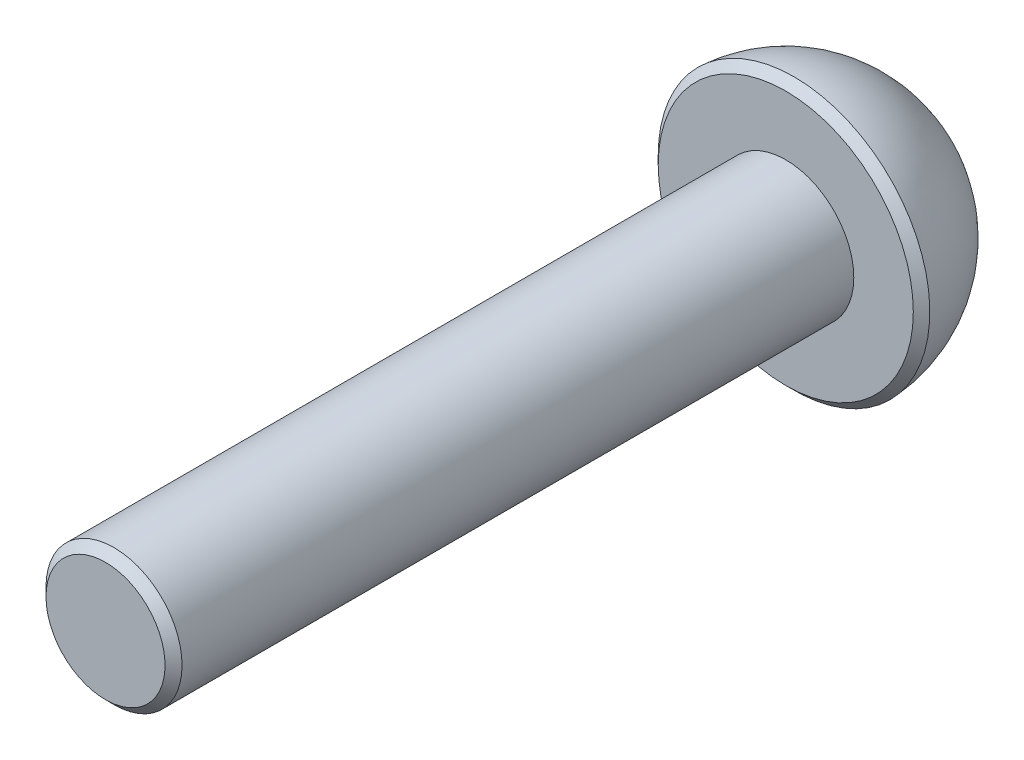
ISO-10303-21;
HEADER;
FILE_DESCRIPTION(('STEP AP214'),'2;1');
FILE_NAME('part.step','',(''),(''),'','','');
FILE_SCHEMA(('AUTOMOTIVE_DESIGN { 1 0 10303 214 1 1 1 1 }'));
ENDSEC;
DATA;
#1=APPLICATION_CONTEXT('core data for automotive mechanical design processes');
#2=APPLICATION_PROTOCOL_DEFINITION('international standard','automotive_design',2000,#1);
#3=PRODUCT_CONTEXT('',#1,'mechanical');
#4=PRODUCT('Part','Part','',(#3));
#5=PRODUCT_RELATED_PRODUCT_CATEGORY('part','',(#4));
#6=PRODUCT_DEFINITION_FORMATION('','',#4);
#7=PRODUCT_DEFINITION_CONTEXT('part definition',#1,'design');
#8=PRODUCT_DEFINITION('design','',#6,#7);
#9=PRODUCT_DEFINITION_SHAPE('','',#8);
#10=(LENGTH_UNIT() NAMED_UNIT(*) SI_UNIT(.MILLI.,.METRE.));
#11=(NAMED_UNIT(*) PLANE_ANGLE_UNIT() SI_UNIT($,.RADIAN.));
#12=(NAMED_UNIT(*) SI_UNIT($,.STERADIAN.) SOLID_ANGLE_UNIT());
#13=UNCERTAINTY_MEASURE_WITH_UNIT(LENGTH_MEASURE(1.E-05),#10,'distance_accuracy_value','');
#14=(GEOMETRIC_REPRESENTATION_CONTEXT(3) GLOBAL_UNCERTAINTY_ASSIGNED_CONTEXT((#13)) GLOBAL_UNIT_ASSIGNED_CONTEXT((#10,
#11,#12)) REPRESENTATION_CONTEXT('',''));
#15=CARTESIAN_POINT('',(0.,0.,0.));
#16=DIRECTION('',(0.,0.,1.));
#17=DIRECTION('',(1.,0.,0.));
#18=AXIS2_PLACEMENT_3D('',#15,#16,#17);
#19=CARTESIAN_POINT('',(0.,0.,0.));
#20=DIRECTION('',(0.,0.,-1.));
#21=DIRECTION('',(-1.,0.,0.));
#22=AXIS2_PLACEMENT_3D('',#19,#20,#21);
#23=PLANE('',#22);
#24=CARTESIAN_POINT('',(0.,0.,0.));
#25=DIRECTION('',(0.,0.,-1.));
#26=DIRECTION('',(-1.,0.,0.));
#27=AXIS2_PLACEMENT_3D('',#24,#25,#26);
#28=CIRCLE('',#27,1.75);
#29=CARTESIAN_POINT('',(-1.75,0.,0.));
#30=VERTEX_POINT('',#29);
#31=EDGE_CURVE('E36',#30,#30,#28,.F.);
#32=ORIENTED_EDGE('',*,*,#31,.T.);
#33=EDGE_LOOP('',(#32));
#34=FACE_BOUND('',#33,.T.);
#35=ADVANCED_FACE('F29',(#34),#23,.F.);
#36=CARTESIAN_POINT('',(0.,0.,-20.));
#37=DIRECTION('',(0.,0.,1.));
#38=DIRECTION('',(0.,1.,0.));
#39=AXIS2_PLACEMENT_3D('',#36,#37,#38);
#40=SPHERICAL_SURFACE('',#39,4.);
#41=CARTESIAN_POINT('',(0.,0.,-20.2426342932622));
#42=DIRECTION('',(0.,0.,1.));
#43=DIRECTION('',(1.,0.,0.));
#44=AXIS2_PLACEMENT_3D('',#41,#42,#43);
#45=CIRCLE('',#44,3.99263429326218);
#46=CARTESIAN_POINT('',(-3.99263429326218,0.,-20.2426342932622));
#47=VERTEX_POINT('',#46);
#48=EDGE_CURVE('E40',#47,#47,#45,.F.);
#49=ORIENTED_EDGE('',*,*,#48,.T.);
#50=EDGE_LOOP('',(#49));
#51=FACE_BOUND('',#50,.T.);
#52=ADVANCED_FACE('F57',(#51),#40,.T.);
#53=CARTESIAN_POINT('',(0.,2.,-20.));
#54=DIRECTION('',(0.,0.,-1.));
#55=DIRECTION('',(-1.,0.,0.));
#56=AXIS2_PLACEMENT_3D('',#53,#54,#55);
#57=PLANE('',#56);
#58=CARTESIAN_POINT('',(0.,0.,-20.));
#59=DIRECTION('',(0.,0.,-1.));
#60=DIRECTION('',(-1.,0.,0.));
#61=AXIS2_PLACEMENT_3D('',#58,#59,#60);
#62=CIRCLE('',#61,3.75);
#63=CARTESIAN_POINT('',(-3.75,0.,-20.));
#64=VERTEX_POINT('',#63);
#65=EDGE_CURVE('E44',#64,#64,#62,.F.);
#66=ORIENTED_EDGE('',*,*,#65,.T.);
#67=EDGE_LOOP('',(#66));
#68=FACE_BOUND('',#67,.T.);
#69=CARTESIAN_POINT('',(0.,0.,-20.));
#70=DIRECTION('',(0.,0.,1.));
#71=DIRECTION('',(1.,0.,0.));
#72=AXIS2_PLACEMENT_3D('',#69,#70,#71);
#73=CIRCLE('',#72,2.);
#74=CARTESIAN_POINT('',(2.,0.,-20.));
#75=VERTEX_POINT('',#74);
#76=EDGE_CURVE('E49',#75,#75,#73,.T.);
#77=ORIENTED_EDGE('',*,*,#76,.F.);
#78=EDGE_LOOP('',(#77));
#79=FACE_BOUND('',#78,.T.);
#80=ADVANCED_FACE('F55',(#68,#79),#57,.F.);
#81=CARTESIAN_POINT('',(0.,0.,0.));
#82=DIRECTION('',(0.,0.,1.));
#83=DIRECTION('',(1.,0.,0.));
#84=AXIS2_PLACEMENT_3D('',#81,#82,#83);
#85=CYLINDRICAL_SURFACE('',#84,2.);
#86=CARTESIAN_POINT('',(0.,0.,-0.250000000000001));
#87=DIRECTION('',(0.,0.,-1.));
#88=DIRECTION('',(-1.,0.,0.));
#89=AXIS2_PLACEMENT_3D('',#86,#87,#88);
#90=CIRCLE('',#89,2.);
#91=CARTESIAN_POINT('',(-2.,0.,-0.250000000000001));
#92=VERTEX_POINT('',#91);
#93=EDGE_CURVE('E10',#92,#92,#90,.T.);
#94=ORIENTED_EDGE('',*,*,#93,.T.);
#95=EDGE_LOOP('',(#94));
#96=FACE_BOUND('',#95,.T.);
#97=ORIENTED_EDGE('',*,*,#76,.T.);
#98=EDGE_LOOP('',(#97));
#99=FACE_BOUND('',#98,.T.);
#100=ADVANCED_FACE('F53',(#96,#99),#85,.T.);
#101=CARTESIAN_POINT('',(0.,0.,-20.));
#102=DIRECTION('',(0.,0.,-1.));
#103=DIRECTION('',(-1.,0.,0.));
#104=AXIS2_PLACEMENT_3D('',#101,#102,#103);
#105=CONICAL_SURFACE('',#104,3.75,0.785398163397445);
#106=CARTESIAN_POINT('',(-3.99263429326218,0.,-20.2426342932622));
#107=CARTESIAN_POINT('',(-3.99010685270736,0.,-20.2401068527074));
#108=CARTESIAN_POINT('',(-3.98757941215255,0.,-20.2375794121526));
#109=CARTESIAN_POINT('',(-3.98252453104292,0.,-20.2325245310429));
#110=CARTESIAN_POINT('',(-3.97999709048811,0.,-20.2299970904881));
#111=CARTESIAN_POINT('',(-3.97494220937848,0.,-20.2249422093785));
#112=CARTESIAN_POINT('',(-3.97241476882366,0.,-20.2224147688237));
#113=CARTESIAN_POINT('',(-3.96735988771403,0.,-20.217359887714));
#114=CARTESIAN_POINT('',(-3.96483244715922,0.,-20.2148324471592));
#115=CARTESIAN_POINT('',(-3.95977756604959,0.,-20.2097775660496));
#116=CARTESIAN_POINT('',(-3.95725012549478,0.,-20.2072501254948));
#117=CARTESIAN_POINT('',(-3.95219524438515,0.,-20.2021952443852));
#118=CARTESIAN_POINT('',(-3.94966780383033,0.,-20.1996678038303));
#119=CARTESIAN_POINT('',(-3.9446129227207,0.,-20.1946129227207));
#120=CARTESIAN_POINT('',(-3.94208548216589,0.,-20.1920854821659));
#121=CARTESIAN_POINT('',(-3.93703060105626,0.,-20.1870306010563));
#122=CARTESIAN_POINT('',(-3.93450316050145,0.,-20.1845031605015));
#123=CARTESIAN_POINT('',(-3.92944827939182,0.,-20.1794482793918));
#124=CARTESIAN_POINT('',(-3.926920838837,0.,-20.176920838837));
#125=CARTESIAN_POINT('',(-3.92186595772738,0.,-20.1718659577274));
#126=CARTESIAN_POINT('',(-3.91933851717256,0.,-20.1693385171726));
#127=CARTESIAN_POINT('',(-3.91428363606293,0.,-20.1642836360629));
#128=CARTESIAN_POINT('',(-3.91175619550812,0.,-20.1617561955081));
#129=CARTESIAN_POINT('',(-3.90670131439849,0.,-20.1567013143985));
#130=CARTESIAN_POINT('',(-3.90417387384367,0.,-20.1541738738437));
#131=CARTESIAN_POINT('',(-3.89911899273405,0.,-20.1491189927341));
#132=CARTESIAN_POINT('',(-3.89659155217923,0.,-20.1465915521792));
#133=CARTESIAN_POINT('',(-3.8915366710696,0.,-20.1415366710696));
#134=CARTESIAN_POINT('',(-3.88900923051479,0.,-20.1390092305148));
#135=CARTESIAN_POINT('',(-3.88395434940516,0.,-20.1339543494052));
#136=CARTESIAN_POINT('',(-3.88142690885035,0.,-20.1314269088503));
#137=CARTESIAN_POINT('',(-3.87637202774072,0.,-20.1263720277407));
#138=CARTESIAN_POINT('',(-3.8738445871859,0.,-20.1238445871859));
#139=CARTESIAN_POINT('',(-3.86878970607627,0.,-20.1187897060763));
#140=CARTESIAN_POINT('',(-3.86626226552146,0.,-20.1162622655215));
#141=CARTESIAN_POINT('',(-3.86120738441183,0.,-20.1112073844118));
#142=CARTESIAN_POINT('',(-3.85867994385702,0.,-20.108679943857));
#143=CARTESIAN_POINT('',(-3.85362506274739,0.,-20.1036250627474));
#144=CARTESIAN_POINT('',(-3.85109762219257,0.,-20.1010976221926));
#145=CARTESIAN_POINT('',(-3.84604274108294,0.,-20.0960427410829));
#146=CARTESIAN_POINT('',(-3.84351530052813,0.,-20.0935153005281));
#147=CARTESIAN_POINT('',(-3.8384604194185,0.,-20.0884604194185));
#148=CARTESIAN_POINT('',(-3.83593297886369,0.,-20.0859329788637));
#149=CARTESIAN_POINT('',(-3.83087809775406,0.,-20.0808780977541));
#150=CARTESIAN_POINT('',(-3.82835065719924,0.,-20.0783506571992));
#151=CARTESIAN_POINT('',(-3.82329577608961,0.,-20.0732957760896));
#152=CARTESIAN_POINT('',(-3.8207683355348,0.,-20.0707683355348));
#153=CARTESIAN_POINT('',(-3.81571345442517,0.,-20.0657134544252));
#154=CARTESIAN_POINT('',(-3.81318601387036,0.,-20.0631860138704));
#155=CARTESIAN_POINT('',(-3.80813113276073,0.,-20.0581311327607));
#156=CARTESIAN_POINT('',(-3.80560369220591,0.,-20.0556036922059));
#157=CARTESIAN_POINT('',(-3.80054881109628,0.,-20.0505488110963));
#158=CARTESIAN_POINT('',(-3.79802137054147,0.,-20.0480213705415));
#159=CARTESIAN_POINT('',(-3.79296648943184,0.,-20.0429664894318));
#160=CARTESIAN_POINT('',(-3.79043904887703,0.,-20.040439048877));
#161=CARTESIAN_POINT('',(-3.7853841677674,0.,-20.0353841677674));
#162=CARTESIAN_POINT('',(-3.78285672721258,0.,-20.0328567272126));
#163=CARTESIAN_POINT('',(-3.77780184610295,0.,-20.027801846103));
#164=CARTESIAN_POINT('',(-3.77527440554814,0.,-20.0252744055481));
#165=CARTESIAN_POINT('',(-3.77021952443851,0.,-20.0202195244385));
#166=CARTESIAN_POINT('',(-3.7676920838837,0.,-20.0176920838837));
#167=CARTESIAN_POINT('',(-3.76263720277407,0.,-20.0126372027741));
#168=CARTESIAN_POINT('',(-3.76010976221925,0.,-20.0101097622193));
#169=CARTESIAN_POINT('',(-3.75505488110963,0.,-20.0050548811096));
#170=CARTESIAN_POINT('',(-3.75252744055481,0.,-20.0025274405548));
#171=CARTESIAN_POINT('',(-3.75,0.,-20.));
#172=B_SPLINE_CURVE_WITH_KNOTS('',3,(#106,#107,#108,#109,#110,#111,#112,#113,#114,#115,#116,
#117,#118,#119,#120,#121,#122,#123,#124,#125,#126,#127,#128,#129,#130,#131,#132,#133,#134,#135,
#136,#137,#138,#139,#140,#141,#142,#143,#144,#145,#146,#147,#148,#149,#150,#151,#152,#153,#154,
#155,#156,#157,#158,#159,#160,#161,#162,#163,#164,#165,#166,#167,#168,#169,#170,#171),
.UNSPECIFIED.,.F.,.F.,(4,2,2,2,2,2,2,2,2,2,2,2,2,2,2,2,2,2,2,2,2,2,2,2,2,2,2,2,2,2,2,2,4),(0.,
0.0107230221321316,0.0214460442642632,0.0321690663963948,0.0428920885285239,0.0536151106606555,
0.0643381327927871,0.0750611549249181,0.0857841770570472,0.0965071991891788,0.10723022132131,
0.117953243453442,0.128676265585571,0.139399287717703,0.150122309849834,0.160845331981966,
0.171568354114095,0.182291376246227,0.193014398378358,0.20373742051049,0.214460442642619,
0.22518346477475,0.235906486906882,0.246629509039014,0.257352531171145,0.268075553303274,
0.278798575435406,0.289521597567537,0.300244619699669,0.310967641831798,0.32169066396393,
0.332413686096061,0.34313670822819),.UNSPECIFIED.);
#173=EDGE_CURVE('BSEAM64',#47,#64,#172,.T.);
#174=ORIENTED_EDGE('',*,*,#48,.F.);
#175=ORIENTED_EDGE('',*,*,#65,.F.);
#176=ORIENTED_EDGE('',*,*,#173,.T.);
#177=ORIENTED_EDGE('',*,*,#173,.F.);
#178=EDGE_LOOP('',(#174,#176,#175,#177));
#179=FACE_BOUND('',#178,.T.);
#180=ADVANCED_FACE('F64',(#179),#105,.T.);
#181=CARTESIAN_POINT('',(0.,0.,0.));
#182=DIRECTION('',(0.,0.,-1.));
#183=DIRECTION('',(-1.,0.,0.));
#184=AXIS2_PLACEMENT_3D('',#181,#182,#183);
#185=CONICAL_SURFACE('',#184,1.75,0.785398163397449);
#186=ORIENTED_EDGE('',*,*,#93,.F.);
#187=EDGE_LOOP('',(#186));
#188=FACE_BOUND('',#187,.T.);
#189=ORIENTED_EDGE('',*,*,#31,.F.);
#190=EDGE_LOOP('',(#189));
#191=FACE_BOUND('',#190,.T.);
#192=ADVANCED_FACE('F31',(#188,#191),#185,.T.);
#193=CLOSED_SHELL('',(#35,#52,#80,#100,#180,#192));
#194=MANIFOLD_SOLID_BREP('B2',#193);
#195=ADVANCED_BREP_SHAPE_REPRESENTATION('',(#18,#194),#14);
#196=SHAPE_DEFINITION_REPRESENTATION(#9,#195);
ENDSEC;
END-ISO-10303-21;
